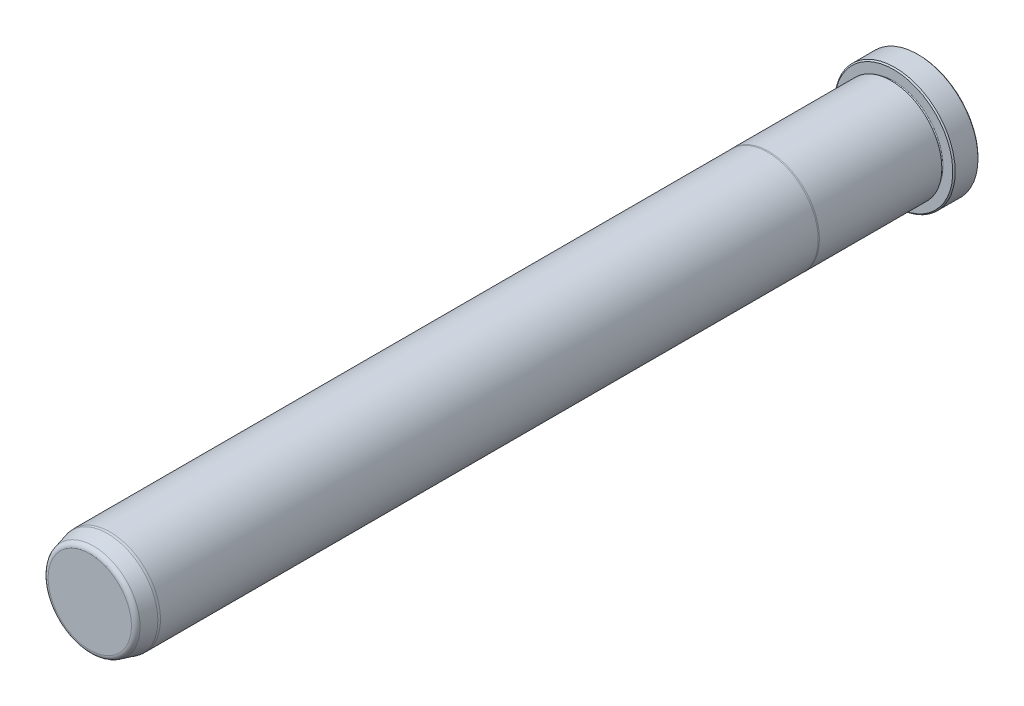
ISO-10303-21;
HEADER;
FILE_DESCRIPTION(('STEP AP214'),'2;1');
FILE_NAME('part.step','',(''),(''),'','','');
FILE_SCHEMA(('AUTOMOTIVE_DESIGN { 1 0 10303 214 1 1 1 1 }'));
ENDSEC;
DATA;
#1=APPLICATION_CONTEXT('core data for automotive mechanical design processes');
#2=APPLICATION_PROTOCOL_DEFINITION('international standard','automotive_design',2000,#1);
#3=PRODUCT_CONTEXT('',#1,'mechanical');
#4=PRODUCT('Part','Part','',(#3));
#5=PRODUCT_RELATED_PRODUCT_CATEGORY('part','',(#4));
#6=PRODUCT_DEFINITION_FORMATION('','',#4);
#7=PRODUCT_DEFINITION_CONTEXT('part definition',#1,'design');
#8=PRODUCT_DEFINITION('design','',#6,#7);
#9=PRODUCT_DEFINITION_SHAPE('','',#8);
#10=(LENGTH_UNIT() NAMED_UNIT(*) SI_UNIT(.MILLI.,.METRE.));
#11=(NAMED_UNIT(*) PLANE_ANGLE_UNIT() SI_UNIT($,.RADIAN.));
#12=(NAMED_UNIT(*) SI_UNIT($,.STERADIAN.) SOLID_ANGLE_UNIT());
#13=UNCERTAINTY_MEASURE_WITH_UNIT(LENGTH_MEASURE(1.E-05),#10,'distance_accuracy_value','');
#14=(GEOMETRIC_REPRESENTATION_CONTEXT(3) GLOBAL_UNCERTAINTY_ASSIGNED_CONTEXT((#13)) GLOBAL_UNIT_ASSIGNED_CONTEXT((#10,
#11,#12)) REPRESENTATION_CONTEXT('',''));
#15=CARTESIAN_POINT('',(0.,0.,0.));
#16=DIRECTION('',(0.,0.,1.));
#17=DIRECTION('',(1.,0.,0.));
#18=AXIS2_PLACEMENT_3D('',#15,#16,#17);
#19=CARTESIAN_POINT('',(0.,0.,0.));
#20=DIRECTION('',(0.,0.,1.));
#21=DIRECTION('',(1.,0.,0.));
#22=AXIS2_PLACEMENT_3D('',#19,#20,#21);
#23=PLANE('',#22);
#24=CARTESIAN_POINT('',(0.,0.,0.));
#25=DIRECTION('',(0.,0.,1.));
#26=DIRECTION('',(1.,0.,0.));
#27=AXIS2_PLACEMENT_3D('',#24,#25,#26);
#28=CIRCLE('',#27,18.542);
#29=CARTESIAN_POINT('',(18.542,0.,0.));
#30=VERTEX_POINT('',#29);
#31=EDGE_CURVE('E37',#30,#30,#28,.F.);
#32=ORIENTED_EDGE('',*,*,#31,.T.);
#33=EDGE_LOOP('',(#32));
#34=FACE_BOUND('',#33,.T.);
#35=ADVANCED_FACE('F30',(#34),#23,.F.);
#36=CARTESIAN_POINT('',(0.,0.,0.));
#37=DIRECTION('',(0.,0.,1.));
#38=DIRECTION('',(1.,0.,0.));
#39=AXIS2_PLACEMENT_3D('',#36,#37,#38);
#40=CYLINDRICAL_SURFACE('',#39,18.923);
#41=CARTESIAN_POINT('',(0.,0.,0.380999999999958));
#42=DIRECTION('',(0.,0.,1.));
#43=DIRECTION('',(1.,0.,0.));
#44=AXIS2_PLACEMENT_3D('',#41,#42,#43);
#45=CIRCLE('',#44,18.923);
#46=CARTESIAN_POINT('',(18.923,0.,0.380999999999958));
#47=VERTEX_POINT('',#46);
#48=EDGE_CURVE('E41',#47,#47,#45,.T.);
#49=ORIENTED_EDGE('',*,*,#48,.T.);
#50=EDGE_LOOP('',(#49));
#51=FACE_BOUND('',#50,.T.);
#52=CARTESIAN_POINT('',(0.,0.,7.54379999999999));
#53=DIRECTION('',(0.,0.,-1.));
#54=DIRECTION('',(-1.,0.,0.));
#55=AXIS2_PLACEMENT_3D('',#52,#53,#54);
#56=CIRCLE('',#55,18.923);
#57=CARTESIAN_POINT('',(-18.923,0.,7.54379999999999));
#58=VERTEX_POINT('',#57);
#59=EDGE_CURVE('E45',#58,#58,#56,.T.);
#60=ORIENTED_EDGE('',*,*,#59,.T.);
#61=EDGE_LOOP('',(#60));
#62=FACE_BOUND('',#61,.T.);
#63=ADVANCED_FACE('F118',(#51,#62),#40,.T.);
#64=CARTESIAN_POINT('',(0.,18.923,7.9248));
#65=DIRECTION('',(0.,0.,-1.));
#66=DIRECTION('',(-1.,0.,0.));
#67=AXIS2_PLACEMENT_3D('',#64,#65,#66);
#68=PLANE('',#67);
#69=CARTESIAN_POINT('',(0.,0.,7.9248));
#70=DIRECTION('',(0.,0.,-1.));
#71=DIRECTION('',(-1.,0.,0.));
#72=AXIS2_PLACEMENT_3D('',#69,#70,#71);
#73=CIRCLE('',#72,18.542);
#74=CARTESIAN_POINT('',(-18.542,0.,7.9248));
#75=VERTEX_POINT('',#74);
#76=EDGE_CURVE('E10',#75,#75,#73,.F.);
#77=ORIENTED_EDGE('',*,*,#76,.T.);
#78=EDGE_LOOP('',(#77));
#79=FACE_BOUND('',#78,.T.);
#80=CARTESIAN_POINT('',(0.,0.,7.9248));
#81=DIRECTION('',(0.,0.,1.));
#82=DIRECTION('',(1.,0.,0.));
#83=AXIS2_PLACEMENT_3D('',#80,#81,#82);
#84=CIRCLE('',#83,15.4813);
#85=CARTESIAN_POINT('',(15.4813,0.,7.9248));
#86=VERTEX_POINT('',#85);
#87=EDGE_CURVE('E56',#86,#86,#84,.T.);
#88=ORIENTED_EDGE('',*,*,#87,.F.);
#89=EDGE_LOOP('',(#88));
#90=FACE_BOUND('',#89,.T.);
#91=ADVANCED_FACE('F113',(#79,#90),#68,.F.);
#92=CARTESIAN_POINT('',(0.,0.,8.3058));
#93=DIRECTION('',(0.,0.,1.));
#94=DIRECTION('',(1.,0.,0.));
#95=AXIS2_PLACEMENT_3D('',#92,#93,#94);
#96=TOROIDAL_SURFACE('',#95,15.4813,0.381000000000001);
#97=CARTESIAN_POINT('',(0.,0.,8.6868));
#98=DIRECTION('',(0.,0.,1.));
#99=DIRECTION('',(1.,0.,0.));
#100=AXIS2_PLACEMENT_3D('',#97,#98,#99);
#101=CIRCLE('',#100,15.4813);
#102=CARTESIAN_POINT('',(15.4813,0.,8.6868));
#103=VERTEX_POINT('',#102);
#104=EDGE_CURVE('E59',#103,#103,#101,.T.);
#105=ORIENTED_EDGE('',*,*,#104,.F.);
#106=EDGE_LOOP('',(#105));
#107=FACE_BOUND('',#106,.T.);
#108=ORIENTED_EDGE('',*,*,#87,.T.);
#109=EDGE_LOOP('',(#108));
#110=FACE_BOUND('',#109,.T.);
#111=ADVANCED_FACE('F107',(#107,#110),#96,.F.);
#112=CARTESIAN_POINT('',(0.,15.4813,8.6868));
#113=DIRECTION('',(0.,0.,1.));
#114=DIRECTION('',(1.,0.,0.));
#115=AXIS2_PLACEMENT_3D('',#112,#113,#114);
#116=PLANE('',#115);
#117=CARTESIAN_POINT('',(0.,0.,8.6868));
#118=DIRECTION('',(0.,0.,1.));
#119=DIRECTION('',(1.,0.,0.));
#120=AXIS2_PLACEMENT_3D('',#117,#118,#119);
#121=CIRCLE('',#120,15.8877);
#122=CARTESIAN_POINT('',(15.8877,0.,8.6868));
#123=VERTEX_POINT('',#122);
#124=EDGE_CURVE('E62',#123,#123,#121,.T.);
#125=ORIENTED_EDGE('',*,*,#124,.F.);
#126=EDGE_LOOP('',(#125));
#127=FACE_BOUND('',#126,.T.);
#128=ORIENTED_EDGE('',*,*,#104,.T.);
#129=EDGE_LOOP('',(#128));
#130=FACE_BOUND('',#129,.T.);
#131=ADVANCED_FACE('F101',(#127,#130),#116,.F.);
#132=CARTESIAN_POINT('',(0.,0.,0.));
#133=DIRECTION('',(0.,0.,1.));
#134=DIRECTION('',(1.,0.,0.));
#135=AXIS2_PLACEMENT_3D('',#132,#133,#134);
#136=CYLINDRICAL_SURFACE('',#135,15.8877);
#137=CARTESIAN_POINT('',(0.,0.,47.1347630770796));
#138=DIRECTION('',(0.,0.,1.));
#139=DIRECTION('',(1.,0.,0.));
#140=AXIS2_PLACEMENT_3D('',#137,#138,#139);
#141=CIRCLE('',#140,15.8877);
#142=CARTESIAN_POINT('',(15.8877,0.,47.1347630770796));
#143=VERTEX_POINT('',#142);
#144=EDGE_CURVE('E65',#143,#143,#141,.T.);
#145=ORIENTED_EDGE('',*,*,#144,.F.);
#146=EDGE_LOOP('',(#145));
#147=FACE_BOUND('',#146,.T.);
#148=ORIENTED_EDGE('',*,*,#124,.T.);
#149=EDGE_LOOP('',(#148));
#150=FACE_BOUND('',#149,.T.);
#151=ADVANCED_FACE('F95',(#147,#150),#136,.T.);
#152=CARTESIAN_POINT('',(0.,0.,47.1347630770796));
#153=DIRECTION('',(0.,0.,-1.));
#154=DIRECTION('',(-1.,0.,0.));
#155=AXIS2_PLACEMENT_3D('',#152,#153,#154);
#156=CONICAL_SURFACE('',#155,15.8877,0.0698131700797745);
#157=CARTESIAN_POINT('',(0.,0.,47.498));
#158=DIRECTION('',(0.,0.,1.));
#159=DIRECTION('',(1.,0.,0.));
#160=AXIS2_PLACEMENT_3D('',#157,#158,#159);
#161=CIRCLE('',#160,15.8623);
#162=CARTESIAN_POINT('',(15.8623,0.,47.498));
#163=VERTEX_POINT('',#162);
#164=EDGE_CURVE('E68',#163,#163,#161,.T.);
#165=ORIENTED_EDGE('',*,*,#164,.F.);
#166=EDGE_LOOP('',(#165));
#167=FACE_BOUND('',#166,.T.);
#168=ORIENTED_EDGE('',*,*,#144,.T.);
#169=EDGE_LOOP('',(#168));
#170=FACE_BOUND('',#169,.T.);
#171=ADVANCED_FACE('F89',(#167,#170),#156,.T.);
#172=CARTESIAN_POINT('',(0.,0.,0.));
#173=DIRECTION('',(0.,0.,1.));
#174=DIRECTION('',(1.,0.,0.));
#175=AXIS2_PLACEMENT_3D('',#172,#173,#174);
#176=CYLINDRICAL_SURFACE('',#175,15.8623);
#177=CARTESIAN_POINT('',(0.,0.,254.));
#178=DIRECTION('',(0.,0.,1.));
#179=DIRECTION('',(1.,0.,0.));
#180=AXIS2_PLACEMENT_3D('',#177,#178,#179);
#181=CIRCLE('',#180,15.8623);
#182=CARTESIAN_POINT('',(15.8623,0.,254.));
#183=VERTEX_POINT('',#182);
#184=EDGE_CURVE('E71',#183,#183,#181,.T.);
#185=ORIENTED_EDGE('',*,*,#184,.F.);
#186=EDGE_LOOP('',(#185));
#187=FACE_BOUND('',#186,.T.);
#188=ORIENTED_EDGE('',*,*,#164,.T.);
#189=EDGE_LOOP('',(#188));
#190=FACE_BOUND('',#189,.T.);
#191=ADVANCED_FACE('F83',(#187,#190),#176,.T.);
#192=CARTESIAN_POINT('',(0.,0.,254.));
#193=DIRECTION('',(0.,0.,-1.));
#194=DIRECTION('',(-1.,0.,0.));
#195=AXIS2_PLACEMENT_3D('',#192,#193,#194);
#196=CONICAL_SURFACE('',#195,15.8623,0.0872664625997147);
#197=CARTESIAN_POINT('',(0.,0.,254.762));
#198=DIRECTION('',(0.,0.,1.));
#199=DIRECTION('',(1.,0.,0.));
#200=AXIS2_PLACEMENT_3D('',#197,#198,#199);
#201=CIRCLE('',#200,15.7956336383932);
#202=CARTESIAN_POINT('',(15.7956336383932,0.,254.762));
#203=VERTEX_POINT('',#202);
#204=EDGE_CURVE('E74',#203,#203,#201,.T.);
#205=ORIENTED_EDGE('',*,*,#204,.F.);
#206=EDGE_LOOP('',(#205));
#207=FACE_BOUND('',#206,.T.);
#208=ORIENTED_EDGE('',*,*,#184,.T.);
#209=EDGE_LOOP('',(#208));
#210=FACE_BOUND('',#209,.T.);
#211=ADVANCED_FACE('F80',(#207,#210),#196,.T.);
#212=CARTESIAN_POINT('',(0.,0.,254.762));
#213=DIRECTION('',(0.,0.,-1.));
#214=DIRECTION('',(-1.,0.,0.));
#215=AXIS2_PLACEMENT_3D('',#212,#213,#214);
#216=CONICAL_SURFACE('',#215,15.7956336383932,0.26179938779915);
#217=CARTESIAN_POINT('',(0.,0.,259.1733752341));
#218=DIRECTION('',(0.,0.,1.));
#219=DIRECTION('',(1.,0.,0.));
#220=AXIS2_PLACEMENT_3D('',#217,#218,#219);
#221=CIRCLE('',#220,14.6136092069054);
#222=CARTESIAN_POINT('',(14.6136092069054,0.,259.1733752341));
#223=VERTEX_POINT('',#222);
#224=EDGE_CURVE('E50',#223,#223,#221,.F.);
#225=ORIENTED_EDGE('',*,*,#224,.T.);
#226=EDGE_LOOP('',(#225));
#227=FACE_BOUND('',#226,.T.);
#228=ORIENTED_EDGE('',*,*,#204,.T.);
#229=EDGE_LOOP('',(#228));
#230=FACE_BOUND('',#229,.T.);
#231=ADVANCED_FACE('F78',(#227,#230),#216,.T.);
#232=CARTESIAN_POINT('',(0.,14.2983335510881,260.35));
#233=DIRECTION('',(0.,0.,-1.));
#234=DIRECTION('',(-1.,0.,0.));
#235=AXIS2_PLACEMENT_3D('',#232,#233,#234);
#236=PLANE('',#235);
#237=CARTESIAN_POINT('',(0.,0.,260.35));
#238=DIRECTION('',(0.,0.,-1.));
#239=DIRECTION('',(-1.,0.,0.));
#240=AXIS2_PLACEMENT_3D('',#237,#238,#239);
#241=CIRCLE('',#240,13.0802019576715);
#242=CARTESIAN_POINT('',(-13.0802019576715,0.,260.35));
#243=VERTEX_POINT('',#242);
#244=EDGE_CURVE('E53',#243,#243,#241,.F.);
#245=ORIENTED_EDGE('',*,*,#244,.T.);
#246=EDGE_LOOP('',(#245));
#247=FACE_BOUND('',#246,.T.);
#248=ADVANCED_FACE('F133',(#247),#236,.F.);
#249=CARTESIAN_POINT('',(0.,0.,258.7625));
#250=DIRECTION('',(0.,0.,-1.));
#251=DIRECTION('',(-1.,0.,0.));
#252=AXIS2_PLACEMENT_3D('',#249,#250,#251);
#253=TOROIDAL_SURFACE('',#252,13.0802019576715,1.5875);
#254=ORIENTED_EDGE('',*,*,#224,.F.);
#255=EDGE_LOOP('',(#254));
#256=FACE_BOUND('',#255,.T.);
#257=ORIENTED_EDGE('',*,*,#244,.F.);
#258=EDGE_LOOP('',(#257));
#259=FACE_BOUND('',#258,.T.);
#260=ADVANCED_FACE('F130',(#256,#259),#253,.T.);
#261=CARTESIAN_POINT('',(0.,0.,0.380999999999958));
#262=DIRECTION('',(0.,0.,1.));
#263=DIRECTION('',(1.,0.,0.));
#264=AXIS2_PLACEMENT_3D('',#261,#262,#263);
#265=CONICAL_SURFACE('',#264,18.923,0.785398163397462);
#266=ORIENTED_EDGE('',*,*,#31,.F.);
#267=EDGE_LOOP('',(#266));
#268=FACE_BOUND('',#267,.T.);
#269=ORIENTED_EDGE('',*,*,#48,.F.);
#270=EDGE_LOOP('',(#269));
#271=FACE_BOUND('',#270,.T.);
#272=ADVANCED_FACE('F132',(#268,#271),#265,.T.);
#273=CARTESIAN_POINT('',(0.,0.,7.9248));
#274=DIRECTION('',(0.,0.,-1.));
#275=DIRECTION('',(-1.,0.,0.));
#276=AXIS2_PLACEMENT_3D('',#273,#274,#275);
#277=CONICAL_SURFACE('',#276,18.542,0.785398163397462);
#278=ORIENTED_EDGE('',*,*,#59,.F.);
#279=EDGE_LOOP('',(#278));
#280=FACE_BOUND('',#279,.T.);
#281=ORIENTED_EDGE('',*,*,#76,.F.);
#282=EDGE_LOOP('',(#281));
#283=FACE_BOUND('',#282,.T.);
#284=ADVANCED_FACE('F32',(#280,#283),#277,.T.);
#285=CLOSED_SHELL('',(#35,#63,#91,#111,#131,#151,#171,#191,#211,#231,#248,#260,#272,#284));
#286=MANIFOLD_SOLID_BREP('B2',#285);
#287=ADVANCED_BREP_SHAPE_REPRESENTATION('',(#18,#286),#14);
#288=SHAPE_DEFINITION_REPRESENTATION(#9,#287);
ENDSEC;
END-ISO-10303-21;
